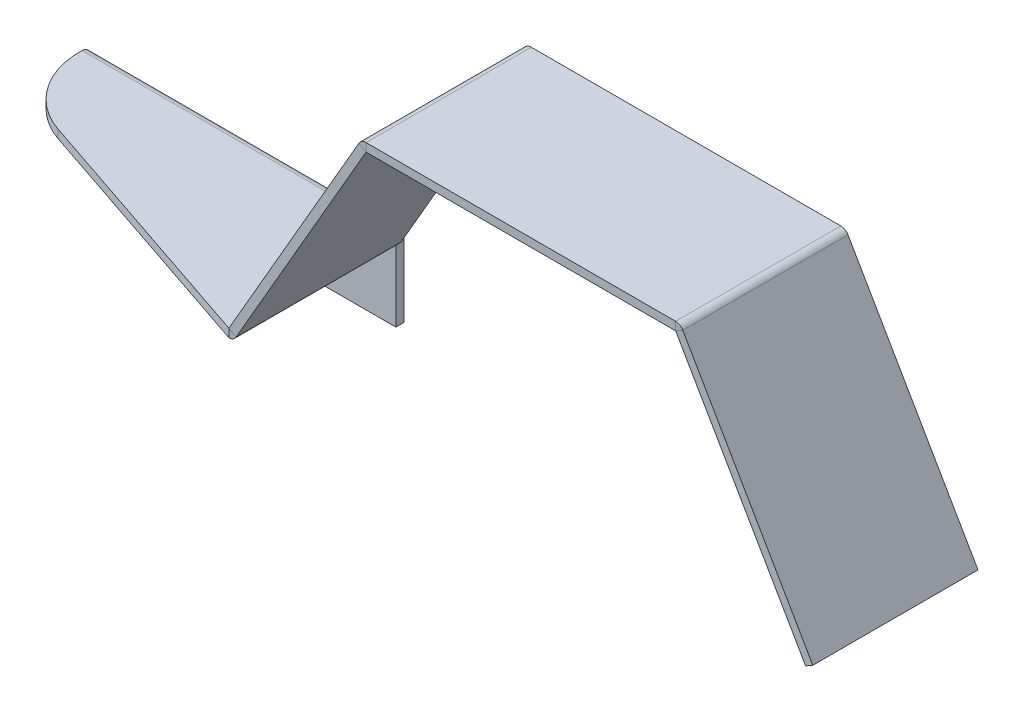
ISO-10303-21;
HEADER;
FILE_DESCRIPTION(('STEP AP214'),'2;1');
FILE_NAME('part.step','',(''),(''),'','','');
FILE_SCHEMA(('AUTOMOTIVE_DESIGN { 1 0 10303 214 1 1 1 1 }'));
ENDSEC;
DATA;
#1=APPLICATION_CONTEXT('core data for automotive mechanical design processes');
#2=APPLICATION_PROTOCOL_DEFINITION('international standard','automotive_design',2000,#1);
#3=PRODUCT_CONTEXT('',#1,'mechanical');
#4=PRODUCT('Part','Part','',(#3));
#5=PRODUCT_RELATED_PRODUCT_CATEGORY('part','',(#4));
#6=PRODUCT_DEFINITION_FORMATION('','',#4);
#7=PRODUCT_DEFINITION_CONTEXT('part definition',#1,'design');
#8=PRODUCT_DEFINITION('design','',#6,#7);
#9=PRODUCT_DEFINITION_SHAPE('','',#8);
#10=(LENGTH_UNIT() NAMED_UNIT(*) SI_UNIT(.MILLI.,.METRE.));
#11=(NAMED_UNIT(*) PLANE_ANGLE_UNIT() SI_UNIT($,.RADIAN.));
#12=(NAMED_UNIT(*) SI_UNIT($,.STERADIAN.) SOLID_ANGLE_UNIT());
#13=UNCERTAINTY_MEASURE_WITH_UNIT(LENGTH_MEASURE(1.E-05),#10,'distance_accuracy_value','');
#14=(GEOMETRIC_REPRESENTATION_CONTEXT(3) GLOBAL_UNCERTAINTY_ASSIGNED_CONTEXT((#13)) GLOBAL_UNIT_ASSIGNED_CONTEXT((#10,
#11,#12)) REPRESENTATION_CONTEXT('',''));
#15=CARTESIAN_POINT('',(0.,0.,0.));
#16=DIRECTION('',(0.,0.,1.));
#17=DIRECTION('',(1.,0.,0.));
#18=AXIS2_PLACEMENT_3D('',#15,#16,#17);
#19=CARTESIAN_POINT('',(50.7385430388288,87.8807344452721,20.2150310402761));
#20=DIRECTION('',(0.,0.,1.));
#21=DIRECTION('',(-0.499999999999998,-0.86602540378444,0.));
#22=AXIS2_PLACEMENT_3D('',#19,#20,#21);
#23=PLANE('',#22);
#24=DIRECTION('',(-0.499999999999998,-0.86602540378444,0.));
#25=VECTOR('',#24,1.);
#26=CARTESIAN_POINT('',(51.6045684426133,87.3807344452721,20.2150310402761));
#27=LINE('',#26,#25);
#28=CARTESIAN_POINT('',(16.6045684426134,26.7589561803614,20.2150310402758));
#29=VERTEX_POINT('',#28);
#30=CARTESIAN_POINT('',(0.866891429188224,-0.499500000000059,20.2150310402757));
#31=VERTEX_POINT('',#30);
#32=EDGE_CURVE('E540',#29,#31,#27,.T.);
#33=ORIENTED_EDGE('',*,*,#32,.F.);
#34=DIRECTION('',(-0.86602540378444,0.499999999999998,0.));
#35=VECTOR('',#34,1.);
#36=CARTESIAN_POINT('',(15.738543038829,27.2589561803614,20.2150310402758));
#37=LINE('',#36,#35);
#38=CARTESIAN_POINT('',(15.738543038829,27.2589561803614,20.2150310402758));
#39=VERTEX_POINT('',#38);
#40=EDGE_CURVE('E533',#29,#39,#37,.T.);
#41=ORIENTED_EDGE('',*,*,#40,.T.);
#42=DIRECTION('',(-0.499999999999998,-0.86602540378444,0.));
#43=VECTOR('',#42,1.);
#44=CARTESIAN_POINT('',(50.7385430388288,87.8807344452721,20.2150310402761));
#45=LINE('',#44,#43);
#46=CARTESIAN_POINT('',(0.000866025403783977,0.00049999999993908,20.2150310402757));
#47=VERTEX_POINT('',#46);
#48=EDGE_CURVE('E61',#39,#47,#45,.T.);
#49=ORIENTED_EDGE('',*,*,#48,.T.);
#50=DIRECTION('',(-0.86602540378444,0.499999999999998,0.));
#51=VECTOR('',#50,1.);
#52=CARTESIAN_POINT('',(0.000866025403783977,0.00049999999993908,20.2150310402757));
#53=LINE('',#52,#51);
#54=EDGE_CURVE('E301',#31,#47,#53,.T.);
#55=ORIENTED_EDGE('',*,*,#54,.F.);
#56=EDGE_LOOP('',(#33,#41,#49,#55));
#57=FACE_BOUND('',#56,.T.);
#58=ADVANCED_FACE('F57',(#57),#23,.T.);
#59=CARTESIAN_POINT('',(-13.3954315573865,-25.202568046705,0.215031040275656));
#60=DIRECTION('',(0.86602540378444,-0.499999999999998,0.));
#61=DIRECTION('',(0.499999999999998,0.86602540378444,0.));
#62=AXIS2_PLACEMENT_3D('',#59,#60,#61);
#63=PLANE('',#62);
#64=DIRECTION('',(0.499999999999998,0.86602540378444,0.));
#65=VECTOR('',#64,1.);
#66=CARTESIAN_POINT('',(0.604568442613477,-0.953856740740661,0.215031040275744));
#67=LINE('',#66,#65);
#68=CARTESIAN_POINT('',(0.866891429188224,-0.499499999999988,0.215031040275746));
#69=VERTEX_POINT('',#68);
#70=CARTESIAN_POINT('',(16.6045684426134,26.7589561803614,0.215031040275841));
#71=VERTEX_POINT('',#70);
#72=EDGE_CURVE('E541',#69,#71,#67,.T.);
#73=ORIENTED_EDGE('',*,*,#72,.T.);
#74=DIRECTION('',(0.,0.,1.));
#75=VECTOR('',#74,1.);
#76=CARTESIAN_POINT('',(16.6045684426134,26.7589561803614,0.215031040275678));
#77=LINE('',#76,#75);
#78=EDGE_CURVE('E66',#71,#29,#77,.T.);
#79=ORIENTED_EDGE('',*,*,#78,.T.);
#80=ORIENTED_EDGE('',*,*,#32,.T.);
#81=DIRECTION('',(0.,0.,1.));
#82=VECTOR('',#81,1.);
#83=CARTESIAN_POINT('',(0.866891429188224,-0.499499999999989,0.215031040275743));
#84=LINE('',#83,#82);
#85=EDGE_CURVE('E304',#69,#31,#84,.T.);
#86=ORIENTED_EDGE('',*,*,#85,.F.);
#87=EDGE_LOOP('',(#73,#79,#80,#86));
#88=FACE_BOUND('',#87,.T.);
#89=ADVANCED_FACE('F618',(#88),#63,.T.);
#90=CARTESIAN_POINT('',(-0.261456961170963,-0.453856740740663,0.215031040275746));
#91=DIRECTION('',(0.,0.,-1.));
#92=DIRECTION('',(-0.86602540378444,0.499999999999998,0.));
#93=AXIS2_PLACEMENT_3D('',#90,#91,#92);
#94=PLANE('',#93);
#95=DIRECTION('',(0.499999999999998,0.86602540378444,0.));
#96=VECTOR('',#95,1.);
#97=CARTESIAN_POINT('',(-0.261456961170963,-0.453856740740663,0.215031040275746));
#98=LINE('',#97,#96);
#99=CARTESIAN_POINT('',(0.00086602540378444,0.00050000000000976,0.215031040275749));
#100=VERTEX_POINT('',#99);
#101=CARTESIAN_POINT('',(15.738543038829,27.2589561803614,0.215031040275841));
#102=VERTEX_POINT('',#101);
#103=EDGE_CURVE('E317',#100,#102,#98,.T.);
#104=ORIENTED_EDGE('',*,*,#103,.T.);
#105=DIRECTION('',(0.86602540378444,-0.499999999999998,0.));
#106=VECTOR('',#105,1.);
#107=CARTESIAN_POINT('',(15.738543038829,27.2589561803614,0.215031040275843));
#108=LINE('',#107,#106);
#109=EDGE_CURVE('E12',#102,#71,#108,.T.);
#110=ORIENTED_EDGE('',*,*,#109,.T.);
#111=ORIENTED_EDGE('',*,*,#72,.F.);
#112=DIRECTION('',(0.86602540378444,-0.499999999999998,0.));
#113=VECTOR('',#112,1.);
#114=CARTESIAN_POINT('',(0.000866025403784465,0.00050000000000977,0.215031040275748));
#115=LINE('',#114,#113);
#116=EDGE_CURVE('E293',#100,#69,#115,.T.);
#117=ORIENTED_EDGE('',*,*,#116,.F.);
#118=EDGE_LOOP('',(#104,#110,#111,#117));
#119=FACE_BOUND('',#118,.T.);
#120=ADVANCED_FACE('F59',(#119),#94,.T.);
#121=CARTESIAN_POINT('',(-28.,-0.99999999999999,0.215031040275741));
#122=DIRECTION('',(0.,-1.,0.));
#123=DIRECTION('',(1.,0.,0.));
#124=AXIS2_PLACEMENT_3D('',#121,#122,#123);
#125=PLANE('',#124);
#126=DIRECTION('',(0.,0.,1.));
#127=VECTOR('',#126,1.);
#128=CARTESIAN_POINT('',(0.,-0.99999999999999,0.215031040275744));
#129=LINE('',#128,#127);
#130=CARTESIAN_POINT('',(0.,-0.99999999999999,0.000999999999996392));
#131=VERTEX_POINT('',#130);
#132=CARTESIAN_POINT('',(0.,-0.99999999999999,0.215031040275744));
#133=VERTEX_POINT('',#132);
#134=EDGE_CURVE('E423',#131,#133,#129,.T.);
#135=ORIENTED_EDGE('',*,*,#134,.T.);
#136=DIRECTION('',(0.,0.,1.));
#137=VECTOR('',#136,1.);
#138=CARTESIAN_POINT('',(0.,-0.99999999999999,0.215031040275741));
#139=LINE('',#138,#137);
#140=CARTESIAN_POINT('',(0.,-1.00000000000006,20.2150310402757));
#141=VERTEX_POINT('',#140);
#142=EDGE_CURVE('E525',#133,#141,#139,.T.);
#143=ORIENTED_EDGE('',*,*,#142,.T.);
#144=DIRECTION('',(-0.947530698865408,0.,-0.319664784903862));
#145=VECTOR('',#144,1.);
#146=CARTESIAN_POINT('',(0.,-1.00000000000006,20.2150310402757));
#147=LINE('',#146,#145);
#148=CARTESIAN_POINT('',(-31.1966478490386,-1.00000000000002,9.69033802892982));
#149=VERTEX_POINT('',#148);
#150=EDGE_CURVE('E518',#141,#149,#147,.T.);
#151=ORIENTED_EDGE('',*,*,#150,.T.);
#152=CARTESIAN_POINT('',(-28.,-0.99999999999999,0.215031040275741));
#153=DIRECTION('',(0.,-1.,0.));
#154=DIRECTION('',(1.,0.,0.));
#155=AXIS2_PLACEMENT_3D('',#152,#153,#154);
#156=CIRCLE('',#155,10.);
#157=CARTESIAN_POINT('',(-37.9977092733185,-0.99999999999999,0.00099999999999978));
#158=VERTEX_POINT('',#157);
#159=EDGE_CURVE('E515',#149,#158,#156,.T.);
#160=ORIENTED_EDGE('',*,*,#159,.T.);
#161=DIRECTION('',(1.,0.,0.));
#162=VECTOR('',#161,1.);
#163=CARTESIAN_POINT('',(-28.,-0.99999999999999,0.000999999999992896));
#164=LINE('',#163,#162);
#165=EDGE_CURVE('E503',#158,#131,#164,.T.);
#166=ORIENTED_EDGE('',*,*,#165,.T.);
#167=EDGE_LOOP('',(#135,#143,#151,#160,#166));
#168=FACE_BOUND('',#167,.T.);
#169=ADVANCED_FACE('F489',(#168),#125,.T.);
#170=CARTESIAN_POINT('',(0.,0.,0.215031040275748));
#171=DIRECTION('',(1.,0.,0.));
#172=DIRECTION('',(0.,0.,1.));
#173=AXIS2_PLACEMENT_3D('',#170,#171,#172);
#174=PLANE('',#173);
#175=ORIENTED_EDGE('',*,*,#134,.F.);
#176=DIRECTION('',(0.,1.,0.));
#177=VECTOR('',#176,1.);
#178=CARTESIAN_POINT('',(0.,0.,0.00100000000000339));
#179=LINE('',#178,#177);
#180=CARTESIAN_POINT('',(0.,0.,0.00100000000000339));
#181=VERTEX_POINT('',#180);
#182=EDGE_CURVE('E512',#131,#181,#179,.T.);
#183=ORIENTED_EDGE('',*,*,#182,.T.);
#184=DIRECTION('',(0.,0.,1.));
#185=VECTOR('',#184,1.);
#186=CARTESIAN_POINT('',(0.,0.,0.215031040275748));
#187=LINE('',#186,#185);
#188=CARTESIAN_POINT('',(0.,0.,0.215031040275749));
#189=VERTEX_POINT('',#188);
#190=EDGE_CURVE('E517',#181,#189,#187,.T.);
#191=ORIENTED_EDGE('',*,*,#190,.T.);
#192=DIRECTION('',(0.,-1.,0.));
#193=VECTOR('',#192,1.);
#194=CARTESIAN_POINT('',(0.,0.,0.215031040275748));
#195=LINE('',#194,#193);
#196=EDGE_CURVE('E528',#189,#133,#195,.T.);
#197=ORIENTED_EDGE('',*,*,#196,.T.);
#198=EDGE_LOOP('',(#175,#183,#191,#197));
#199=FACE_BOUND('',#198,.T.);
#200=ADVANCED_FACE('F486',(#199),#174,.T.);
#201=CARTESIAN_POINT('',(-28.,0.,0.215031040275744));
#202=DIRECTION('',(0.,-1.,0.));
#203=DIRECTION('',(1.,0.,0.));
#204=AXIS2_PLACEMENT_3D('',#201,#202,#203);
#205=CYLINDRICAL_SURFACE('',#204,10.);
#206=CARTESIAN_POINT('',(-28.,0.,0.215031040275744));
#207=DIRECTION('',(0.,-1.,0.));
#208=DIRECTION('',(1.,0.,0.));
#209=AXIS2_PLACEMENT_3D('',#206,#207,#208);
#210=CIRCLE('',#209,10.);
#211=CARTESIAN_POINT('',(-31.1966478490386,0.,9.69033802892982));
#212=VERTEX_POINT('',#211);
#213=CARTESIAN_POINT('',(-37.9977092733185,0.,0.00100000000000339));
#214=VERTEX_POINT('',#213);
#215=EDGE_CURVE('E572',#212,#214,#210,.T.);
#216=ORIENTED_EDGE('',*,*,#215,.T.);
#217=CARTESIAN_POINT('',(-37.9977092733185,-0.99999999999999,0.000999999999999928));
#218=CARTESIAN_POINT('',(-37.9977092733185,0.,0.00100000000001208));
#219=B_SPLINE_CURVE_WITH_KNOTS('',1,(#217,#218),.UNSPECIFIED.,.F.,.F.,(2,2),(0.,1.),.UNSPECIFIED.);
#220=EDGE_CURVE('E511',#214,#158,#219,.F.);
#221=ORIENTED_EDGE('',*,*,#220,.T.);
#222=ORIENTED_EDGE('',*,*,#159,.F.);
#223=DIRECTION('',(0.,-1.,0.));
#224=VECTOR('',#223,1.);
#225=CARTESIAN_POINT('',(-31.1966478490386,0.,9.69033802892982));
#226=LINE('',#225,#224);
#227=EDGE_CURVE('E579',#212,#149,#226,.T.);
#228=ORIENTED_EDGE('',*,*,#227,.F.);
#229=EDGE_LOOP('',(#216,#221,#222,#228));
#230=FACE_BOUND('',#229,.T.);
#231=ADVANCED_FACE('F484',(#230),#205,.T.);
#232=CARTESIAN_POINT('',(0.,0.,20.2150310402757));
#233=DIRECTION('',(-0.319664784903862,0.,0.947530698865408));
#234=DIRECTION('',(-0.947530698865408,0.,-0.319664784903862));
#235=AXIS2_PLACEMENT_3D('',#232,#233,#234);
#236=PLANE('',#235);
#237=ORIENTED_EDGE('',*,*,#150,.F.);
#238=DIRECTION('',(0.,-1.,0.));
#239=VECTOR('',#238,1.);
#240=CARTESIAN_POINT('',(0.,0.,20.2150310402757));
#241=LINE('',#240,#239);
#242=CARTESIAN_POINT('',(0.,0.,20.2150310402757));
#243=VERTEX_POINT('',#242);
#244=EDGE_CURVE('E523',#243,#141,#241,.T.);
#245=ORIENTED_EDGE('',*,*,#244,.F.);
#246=DIRECTION('',(-0.947530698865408,0.,-0.319664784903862));
#247=VECTOR('',#246,1.);
#248=CARTESIAN_POINT('',(0.,0.,20.2150310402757));
#249=LINE('',#248,#247);
#250=EDGE_CURVE('E568',#243,#212,#249,.T.);
#251=ORIENTED_EDGE('',*,*,#250,.T.);
#252=ORIENTED_EDGE('',*,*,#227,.T.);
#253=EDGE_LOOP('',(#237,#245,#251,#252));
#254=FACE_BOUND('',#253,.T.);
#255=ADVANCED_FACE('F480',(#254),#236,.T.);
#256=CARTESIAN_POINT('',(-28.,0.,0.215031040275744));
#257=DIRECTION('',(0.,-1.,0.));
#258=DIRECTION('',(1.,0.,0.));
#259=AXIS2_PLACEMENT_3D('',#256,#257,#258);
#260=PLANE('',#259);
#261=DIRECTION('',(0.,0.,1.));
#262=VECTOR('',#261,1.);
#263=CARTESIAN_POINT('',(0.,0.,0.215031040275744));
#264=LINE('',#263,#262);
#265=EDGE_CURVE('E521',#189,#243,#264,.T.);
#266=ORIENTED_EDGE('',*,*,#265,.F.);
#267=ORIENTED_EDGE('',*,*,#190,.F.);
#268=DIRECTION('',(1.,0.,0.));
#269=VECTOR('',#268,1.);
#270=CARTESIAN_POINT('',(-28.,0.,0.00100000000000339));
#271=LINE('',#270,#269);
#272=EDGE_CURVE('E577',#214,#181,#271,.T.);
#273=ORIENTED_EDGE('',*,*,#272,.F.);
#274=ORIENTED_EDGE('',*,*,#215,.F.);
#275=ORIENTED_EDGE('',*,*,#250,.F.);
#276=EDGE_LOOP('',(#266,#267,#273,#274,#275));
#277=FACE_BOUND('',#276,.T.);
#278=ADVANCED_FACE('F483',(#277),#260,.F.);
#279=CARTESIAN_POINT('',(0.,-10.,-1.));
#280=DIRECTION('',(0.,-1.,0.));
#281=DIRECTION('',(1.,0.,0.));
#282=AXIS2_PLACEMENT_3D('',#279,#280,#281);
#283=PLANE('',#282);
#284=DIRECTION('',(1.,0.,0.));
#285=VECTOR('',#284,1.);
#286=CARTESIAN_POINT('',(0.,-10.,0.));
#287=LINE('',#286,#285);
#288=CARTESIAN_POINT('',(-28.,-10.,0.));
#289=VERTEX_POINT('',#288);
#290=CARTESIAN_POINT('',(0.,-10.,0.));
#291=VERTEX_POINT('',#290);
#292=EDGE_CURVE('E427',#289,#291,#287,.T.);
#293=ORIENTED_EDGE('',*,*,#292,.F.);
#294=DIRECTION('',(0.,0.,1.));
#295=VECTOR('',#294,1.);
#296=CARTESIAN_POINT('',(-28.,-10.,-1.));
#297=LINE('',#296,#295);
#298=CARTESIAN_POINT('',(-28.,-10.,-1.));
#299=VERTEX_POINT('',#298);
#300=EDGE_CURVE('E415',#299,#289,#297,.T.);
#301=ORIENTED_EDGE('',*,*,#300,.F.);
#302=DIRECTION('',(1.,0.,0.));
#303=VECTOR('',#302,1.);
#304=CARTESIAN_POINT('',(0.,-10.,-1.));
#305=LINE('',#304,#303);
#306=CARTESIAN_POINT('',(0.,-10.,-1.));
#307=VERTEX_POINT('',#306);
#308=EDGE_CURVE('E448',#299,#307,#305,.T.);
#309=ORIENTED_EDGE('',*,*,#308,.T.);
#310=DIRECTION('',(0.,0.,1.));
#311=VECTOR('',#310,1.);
#312=CARTESIAN_POINT('',(0.,-10.,-1.));
#313=LINE('',#312,#311);
#314=EDGE_CURVE('E446',#307,#291,#313,.T.);
#315=ORIENTED_EDGE('',*,*,#314,.T.);
#316=EDGE_LOOP('',(#293,#301,#309,#315));
#317=FACE_BOUND('',#316,.T.);
#318=ADVANCED_FACE('F388',(#317),#283,.T.);
#319=CARTESIAN_POINT('',(-28.,-5.,-1.));
#320=DIRECTION('',(0.,0.,1.));
#321=DIRECTION('',(1.,0.,0.));
#322=AXIS2_PLACEMENT_3D('',#319,#320,#321);
#323=CYLINDRICAL_SURFACE('',#322,1.75);
#324=CARTESIAN_POINT('',(-28.,-5.,-1.));
#325=DIRECTION('',(0.,0.,1.));
#326=DIRECTION('',(1.,0.,0.));
#327=AXIS2_PLACEMENT_3D('',#324,#325,#326);
#328=CIRCLE('',#327,1.75);
#329=CARTESIAN_POINT('',(-26.25,-5.,-1.));
#330=VERTEX_POINT('',#329);
#331=EDGE_CURVE('E434',#330,#330,#328,.T.);
#332=ORIENTED_EDGE('',*,*,#331,.F.);
#333=EDGE_LOOP('',(#332));
#334=FACE_BOUND('',#333,.T.);
#335=CARTESIAN_POINT('',(-28.,-5.,0.));
#336=DIRECTION('',(0.,0.,1.));
#337=DIRECTION('',(1.,0.,0.));
#338=AXIS2_PLACEMENT_3D('',#335,#336,#337);
#339=CIRCLE('',#338,1.75);
#340=CARTESIAN_POINT('',(-26.25,-5.,0.));
#341=VERTEX_POINT('',#340);
#342=EDGE_CURVE('E443',#341,#341,#339,.T.);
#343=ORIENTED_EDGE('',*,*,#342,.T.);
#344=EDGE_LOOP('',(#343));
#345=FACE_BOUND('',#344,.T.);
#346=ADVANCED_FACE('F1000',(#334,#345),#323,.F.);
#347=CARTESIAN_POINT('',(-8.,-5.,-1.));
#348=DIRECTION('',(0.,0.,1.));
#349=DIRECTION('',(1.,0.,0.));
#350=AXIS2_PLACEMENT_3D('',#347,#348,#349);
#351=CYLINDRICAL_SURFACE('',#350,1.75);
#352=CARTESIAN_POINT('',(-8.,-5.,-1.));
#353=DIRECTION('',(0.,0.,1.));
#354=DIRECTION('',(1.,0.,0.));
#355=AXIS2_PLACEMENT_3D('',#352,#353,#354);
#356=CIRCLE('',#355,1.75);
#357=CARTESIAN_POINT('',(-6.25,-5.,-1.));
#358=VERTEX_POINT('',#357);
#359=EDGE_CURVE('E437',#358,#358,#356,.T.);
#360=ORIENTED_EDGE('',*,*,#359,.F.);
#361=EDGE_LOOP('',(#360));
#362=FACE_BOUND('',#361,.T.);
#363=CARTESIAN_POINT('',(-8.,-5.,0.));
#364=DIRECTION('',(0.,0.,1.));
#365=DIRECTION('',(1.,0.,0.));
#366=AXIS2_PLACEMENT_3D('',#363,#364,#365);
#367=CIRCLE('',#366,1.75);
#368=CARTESIAN_POINT('',(-6.25,-5.,0.));
#369=VERTEX_POINT('',#368);
#370=EDGE_CURVE('E440',#369,#369,#367,.T.);
#371=ORIENTED_EDGE('',*,*,#370,.T.);
#372=EDGE_LOOP('',(#371));
#373=FACE_BOUND('',#372,.T.);
#374=ADVANCED_FACE('F968',(#362,#373),#351,.F.);
#375=CARTESIAN_POINT('',(-28.,0.,-1.));
#376=DIRECTION('',(0.,0.,1.));
#377=DIRECTION('',(1.,0.,0.));
#378=AXIS2_PLACEMENT_3D('',#375,#376,#377);
#379=PLANE('',#378);
#380=ORIENTED_EDGE('',*,*,#359,.T.);
#381=EDGE_LOOP('',(#380));
#382=FACE_BOUND('',#381,.T.);
#383=ORIENTED_EDGE('',*,*,#331,.T.);
#384=EDGE_LOOP('',(#383));
#385=FACE_BOUND('',#384,.T.);
#386=CARTESIAN_POINT('',(-28.,0.,-1.));
#387=DIRECTION('',(0.,0.,1.));
#388=DIRECTION('',(1.,0.,0.));
#389=AXIS2_PLACEMENT_3D('',#386,#387,#388);
#390=CIRCLE('',#389,10.);
#391=CARTESIAN_POINT('',(-37.9497738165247,-1.00099999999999,-1.));
#392=VERTEX_POINT('',#391);
#393=EDGE_CURVE('E424',#392,#299,#390,.T.);
#394=ORIENTED_EDGE('',*,*,#393,.F.);
#395=DIRECTION('',(1.,0.,0.));
#396=VECTOR('',#395,1.);
#397=CARTESIAN_POINT('',(-28.,-1.00099999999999,-1.));
#398=LINE('',#397,#396);
#399=CARTESIAN_POINT('',(0.,-1.00099999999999,-1.));
#400=VERTEX_POINT('',#399);
#401=EDGE_CURVE('E433',#392,#400,#398,.T.);
#402=ORIENTED_EDGE('',*,*,#401,.T.);
#403=DIRECTION('',(0.,1.,0.));
#404=VECTOR('',#403,1.);
#405=CARTESIAN_POINT('',(0.,0.,-1.));
#406=LINE('',#405,#404);
#407=EDGE_CURVE('E431',#307,#400,#406,.T.);
#408=ORIENTED_EDGE('',*,*,#407,.F.);
#409=ORIENTED_EDGE('',*,*,#308,.F.);
#410=EDGE_LOOP('',(#394,#402,#408,#409));
#411=FACE_BOUND('',#410,.T.);
#412=ADVANCED_FACE('F600',(#382,#385,#411),#379,.F.);
#413=CARTESIAN_POINT('',(0.,0.,-1.));
#414=DIRECTION('',(1.,0.,0.));
#415=DIRECTION('',(0.,1.,0.));
#416=AXIS2_PLACEMENT_3D('',#413,#414,#415);
#417=PLANE('',#416);
#418=DIRECTION('',(0.,0.,-1.));
#419=VECTOR('',#418,1.);
#420=CARTESIAN_POINT('',(0.,-1.00099999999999,-1.00000000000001));
#421=LINE('',#420,#419);
#422=CARTESIAN_POINT('',(0.,-1.001,0.));
#423=VERTEX_POINT('',#422);
#424=EDGE_CURVE('E451',#423,#400,#421,.T.);
#425=ORIENTED_EDGE('',*,*,#424,.F.);
#426=DIRECTION('',(0.,1.,0.));
#427=VECTOR('',#426,1.);
#428=CARTESIAN_POINT('',(0.,0.,0.));
#429=LINE('',#428,#427);
#430=EDGE_CURVE('E425',#291,#423,#429,.T.);
#431=ORIENTED_EDGE('',*,*,#430,.F.);
#432=ORIENTED_EDGE('',*,*,#314,.F.);
#433=ORIENTED_EDGE('',*,*,#407,.T.);
#434=EDGE_LOOP('',(#425,#431,#432,#433));
#435=FACE_BOUND('',#434,.T.);
#436=ADVANCED_FACE('F603',(#435),#417,.T.);
#437=CARTESIAN_POINT('',(-28.,0.,0.));
#438=DIRECTION('',(0.,0.,1.));
#439=DIRECTION('',(1.,0.,0.));
#440=AXIS2_PLACEMENT_3D('',#437,#438,#439);
#441=PLANE('',#440);
#442=DIRECTION('',(1.,0.,0.));
#443=VECTOR('',#442,1.);
#444=CARTESIAN_POINT('',(-28.,-1.001,0.));
#445=LINE('',#444,#443);
#446=CARTESIAN_POINT('',(-37.9497738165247,-1.001,0.));
#447=VERTEX_POINT('',#446);
#448=EDGE_CURVE('E454',#447,#423,#445,.T.);
#449=ORIENTED_EDGE('',*,*,#448,.F.);
#450=CARTESIAN_POINT('',(-28.,0.,0.));
#451=DIRECTION('',(0.,0.,1.));
#452=DIRECTION('',(1.,0.,0.));
#453=AXIS2_PLACEMENT_3D('',#450,#451,#452);
#454=CIRCLE('',#453,10.);
#455=EDGE_CURVE('E430',#447,#289,#454,.T.);
#456=ORIENTED_EDGE('',*,*,#455,.T.);
#457=ORIENTED_EDGE('',*,*,#292,.T.);
#458=ORIENTED_EDGE('',*,*,#430,.T.);
#459=EDGE_LOOP('',(#449,#456,#457,#458));
#460=FACE_BOUND('',#459,.T.);
#461=ORIENTED_EDGE('',*,*,#342,.F.);
#462=EDGE_LOOP('',(#461));
#463=FACE_BOUND('',#462,.T.);
#464=ORIENTED_EDGE('',*,*,#370,.F.);
#465=EDGE_LOOP('',(#464));
#466=FACE_BOUND('',#465,.T.);
#467=ADVANCED_FACE('F478',(#460,#463,#466),#441,.T.);
#468=CARTESIAN_POINT('',(-28.,0.,-1.));
#469=DIRECTION('',(0.,0.,1.));
#470=DIRECTION('',(1.,0.,0.));
#471=AXIS2_PLACEMENT_3D('',#468,#469,#470);
#472=CYLINDRICAL_SURFACE('',#471,10.);
#473=CARTESIAN_POINT('',(-37.9497738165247,-1.00099999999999,-1.));
#474=CARTESIAN_POINT('',(-37.9497738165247,-1.00099999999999,0.));
#475=B_SPLINE_CURVE_WITH_KNOTS('',1,(#473,#474),.UNSPECIFIED.,.F.,.F.,(2,2),(0.,1.),.UNSPECIFIED.);
#476=EDGE_CURVE('E323',#392,#447,#475,.T.);
#477=ORIENTED_EDGE('',*,*,#476,.F.);
#478=ORIENTED_EDGE('',*,*,#393,.T.);
#479=ORIENTED_EDGE('',*,*,#300,.T.);
#480=ORIENTED_EDGE('',*,*,#455,.F.);
#481=EDGE_LOOP('',(#477,#478,#479,#480));
#482=FACE_BOUND('',#481,.T.);
#483=ADVANCED_FACE('F387',(#482),#472,.T.);
#484=CARTESIAN_POINT('',(-37.9497738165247,-1.00099999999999,-1.));
#485=CARTESIAN_POINT('',(-37.9537691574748,-0.869945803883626,-1.));
#486=CARTESIAN_POINT('',(-37.9577630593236,-0.738990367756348,-0.973946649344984));
#487=CARTESIAN_POINT('',(-37.9657523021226,-0.496877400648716,-0.87366017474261));
#488=CARTESIAN_POINT('',(-37.9697469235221,-0.385838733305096,-0.799466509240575));
#489=CARTESIAN_POINT('',(-37.9777361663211,-0.200533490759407,-0.614161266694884));
#490=CARTESIAN_POINT('',(-37.9817307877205,-0.126339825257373,-0.503122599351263));
#491=CARTESIAN_POINT('',(-37.9897200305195,-0.026053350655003,-0.26100963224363));
#492=CARTESIAN_POINT('',(-37.9937139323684,0.,-0.130054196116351));
#493=CARTESIAN_POINT('',(-37.9977092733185,0.,0.00100000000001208));
#494=CARTESIAN_POINT('',(-37.9497738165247,-1.00099999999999,0.));
#495=CARTESIAN_POINT('',(-37.9537684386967,-1.00086910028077,0.));
#496=CARTESIAN_POINT('',(-37.9577630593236,-1.00073825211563,2.60273233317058E-05));
#497=CARTESIAN_POINT('',(-37.9657523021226,-1.00049638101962,0.000126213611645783));
#498=CARTESIAN_POINT('',(-37.9697469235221,-1.00038545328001,0.000200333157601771));
#499=CARTESIAN_POINT('',(-37.9777361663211,-1.00020033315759,0.00038545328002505));
#500=CARTESIAN_POINT('',(-37.9817307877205,-1.00012621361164,0.000496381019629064));
#501=CARTESIAN_POINT('',(-37.9897200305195,-1.00002602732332,0.000738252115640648));
#502=CARTESIAN_POINT('',(-37.9937146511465,-0.99999999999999,0.000869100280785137));
#503=CARTESIAN_POINT('',(-37.9977092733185,-0.99999999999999,0.000999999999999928));
#504=B_SPLINE_SURFACE_WITH_KNOTS('',1,3,((#484,#485,#486,#487,#488,#489,#490,#491,#492,#493),
(#494,#495,#496,#497,#498,#499,#500,#501,#502,#503)),.UNSPECIFIED.,.F.,.F.,.F.,(2,2),(4,2,2,2,
4),(0.,1.),(0.,0.25,0.5,0.75,1.),.UNSPECIFIED.);
#505=CARTESIAN_POINT('',(-37.9497738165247,-1.00099999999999,0.));
#506=CARTESIAN_POINT('',(-37.9537684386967,-1.00086910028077,0.));
#507=CARTESIAN_POINT('',(-37.9577630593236,-1.00073825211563,2.60273233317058E-05));
#508=CARTESIAN_POINT('',(-37.9657523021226,-1.00049638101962,0.000126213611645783));
#509=CARTESIAN_POINT('',(-37.9697469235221,-1.00038545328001,0.000200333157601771));
#510=CARTESIAN_POINT('',(-37.9777361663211,-1.00020033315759,0.00038545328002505));
#511=CARTESIAN_POINT('',(-37.9817307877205,-1.00012621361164,0.000496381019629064));
#512=CARTESIAN_POINT('',(-37.9897200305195,-1.00002602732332,0.000738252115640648));
#513=CARTESIAN_POINT('',(-37.9937146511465,-0.99999999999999,0.000869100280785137));
#514=CARTESIAN_POINT('',(-37.9977092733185,-0.99999999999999,0.000999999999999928));
#515=B_SPLINE_CURVE_WITH_KNOTS('',3,(#505,#506,#507,#508,#509,#510,#511,#512,#513,#514),
.UNSPECIFIED.,.F.,.F.,(4,2,2,2,4),(0.,0.25,0.5,0.75,1.),.UNSPECIFIED.);
#516=EDGE_CURVE('E315',#447,#158,#515,.T.);
#517=CARTESIAN_POINT('',(-37.9977092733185,0.,0.00100000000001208));
#518=CARTESIAN_POINT('',(-37.9937139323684,0.,-0.130054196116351));
#519=CARTESIAN_POINT('',(-37.9897200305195,-0.026053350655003,-0.26100963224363));
#520=CARTESIAN_POINT('',(-37.9817307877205,-0.126339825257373,-0.503122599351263));
#521=CARTESIAN_POINT('',(-37.9777361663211,-0.200533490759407,-0.614161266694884));
#522=CARTESIAN_POINT('',(-37.9697469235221,-0.385838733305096,-0.799466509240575));
#523=CARTESIAN_POINT('',(-37.9657523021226,-0.496877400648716,-0.87366017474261));
#524=CARTESIAN_POINT('',(-37.9577630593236,-0.738990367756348,-0.973946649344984));
#525=CARTESIAN_POINT('',(-37.9537691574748,-0.869945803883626,-1.));
#526=CARTESIAN_POINT('',(-37.9497738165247,-1.00099999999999,-1.));
#527=B_SPLINE_CURVE_WITH_KNOTS('',3,(#517,#518,#519,#520,#521,#522,#523,#524,#525,#526),
.UNSPECIFIED.,.F.,.F.,(4,2,2,2,4),(0.,0.25,0.5,0.75,1.),.UNSPECIFIED.);
#528=EDGE_CURVE('E324',#392,#214,#527,.F.);
#529=ORIENTED_EDGE('',*,*,#476,.T.);
#530=ORIENTED_EDGE('',*,*,#516,.T.);
#531=ORIENTED_EDGE('',*,*,#220,.F.);
#532=ORIENTED_EDGE('',*,*,#528,.F.);
#533=EDGE_LOOP('',(#529,#530,#531,#532));
#534=FACE_BOUND('',#533,.T.);
#535=ADVANCED_FACE('F376',(#534),#504,.T.);
#536=CARTESIAN_POINT('',(0.,-1.00099999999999,0.000999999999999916));
#537=DIRECTION('',(1.,0.,0.));
#538=DIRECTION('',(0.,0.,-1.));
#539=AXIS2_PLACEMENT_3D('',#536,#537,#538);
#540=PLANE('',#539);
#541=ORIENTED_EDGE('',*,*,#182,.F.);
#542=CARTESIAN_POINT('',(0.,-1.00099999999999,0.000999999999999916));
#543=DIRECTION('',(1.,0.,0.));
#544=DIRECTION('',(0.,0.,-1.));
#545=AXIS2_PLACEMENT_3D('',#542,#543,#544);
#546=CIRCLE('',#545,0.000999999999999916);
#547=EDGE_CURVE('E325',#131,#423,#546,.F.);
#548=ORIENTED_EDGE('',*,*,#547,.T.);
#549=ORIENTED_EDGE('',*,*,#424,.T.);
#550=CARTESIAN_POINT('',(0.,-1.00099999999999,0.000999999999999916));
#551=DIRECTION('',(-1.,0.,0.));
#552=DIRECTION('',(0.,0.,-1.));
#553=AXIS2_PLACEMENT_3D('',#550,#551,#552);
#554=CIRCLE('',#553,1.001);
#555=EDGE_CURVE('E320',#181,#400,#554,.T.);
#556=ORIENTED_EDGE('',*,*,#555,.F.);
#557=EDGE_LOOP('',(#541,#548,#549,#556));
#558=FACE_BOUND('',#557,.T.);
#559=ADVANCED_FACE('F345',(#558),#540,.T.);
#560=CARTESIAN_POINT('',(-56.9938983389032,-1.00099999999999,0.000999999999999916));
#561=DIRECTION('',(1.,0.,0.));
#562=DIRECTION('',(0.,0.,-1.));
#563=AXIS2_PLACEMENT_3D('',#560,#561,#562);
#564=CYLINDRICAL_SURFACE('',#563,1.001);
#565=ORIENTED_EDGE('',*,*,#555,.T.);
#566=ORIENTED_EDGE('',*,*,#401,.F.);
#567=ORIENTED_EDGE('',*,*,#528,.T.);
#568=ORIENTED_EDGE('',*,*,#272,.T.);
#569=EDGE_LOOP('',(#565,#566,#567,#568));
#570=FACE_BOUND('',#569,.T.);
#571=ADVANCED_FACE('F334',(#570),#564,.T.);
#572=CARTESIAN_POINT('',(-56.9938983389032,-1.00099999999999,0.000999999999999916));
#573=DIRECTION('',(1.,0.,0.));
#574=DIRECTION('',(0.,0.,-1.));
#575=AXIS2_PLACEMENT_3D('',#572,#573,#574);
#576=CYLINDRICAL_SURFACE('',#575,0.000999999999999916);
#577=ORIENTED_EDGE('',*,*,#547,.F.);
#578=ORIENTED_EDGE('',*,*,#165,.F.);
#579=ORIENTED_EDGE('',*,*,#516,.F.);
#580=ORIENTED_EDGE('',*,*,#448,.T.);
#581=EDGE_LOOP('',(#577,#578,#579,#580));
#582=FACE_BOUND('',#581,.T.);
#583=ADVANCED_FACE('F344',(#582),#576,.F.);
#584=CARTESIAN_POINT('',(0.,0.00100000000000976,0.215031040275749));
#585=DIRECTION('',(0.,0.,1.));
#586=DIRECTION('',(1.,0.,0.));
#587=AXIS2_PLACEMENT_3D('',#584,#585,#586);
#588=PLANE('',#587);
#589=ORIENTED_EDGE('',*,*,#116,.T.);
#590=CARTESIAN_POINT('',(0.,0.00100000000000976,0.215031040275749));
#591=DIRECTION('',(0.,0.,-1.));
#592=DIRECTION('',(0.,1.,0.));
#593=AXIS2_PLACEMENT_3D('',#590,#591,#592);
#594=CIRCLE('',#593,1.001);
#595=EDGE_CURVE('E82',#69,#133,#594,.T.);
#596=ORIENTED_EDGE('',*,*,#595,.T.);
#597=ORIENTED_EDGE('',*,*,#196,.F.);
#598=CARTESIAN_POINT('',(0.,0.00100000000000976,0.215031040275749));
#599=DIRECTION('',(0.,0.,-1.));
#600=DIRECTION('',(1.,0.,0.));
#601=AXIS2_PLACEMENT_3D('',#598,#599,#600);
#602=CIRCLE('',#601,0.001);
#603=EDGE_CURVE('E308',#100,#189,#602,.T.);
#604=ORIENTED_EDGE('',*,*,#603,.F.);
#605=EDGE_LOOP('',(#589,#596,#597,#604));
#606=FACE_BOUND('',#605,.T.);
#607=ADVANCED_FACE('F352',(#606),#588,.F.);
#608=CARTESIAN_POINT('',(0.,0.000999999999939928,20.2150310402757));
#609=DIRECTION('',(0.,0.,-1.));
#610=DIRECTION('',(-1.,0.,0.));
#611=AXIS2_PLACEMENT_3D('',#608,#609,#610);
#612=PLANE('',#611);
#613=CARTESIAN_POINT('',(0.,0.000999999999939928,20.2150310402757));
#614=DIRECTION('',(0.,0.,-1.));
#615=DIRECTION('',(0.,1.,0.));
#616=AXIS2_PLACEMENT_3D('',#613,#614,#615);
#617=CIRCLE('',#616,1.001);
#618=EDGE_CURVE('E312',#141,#31,#617,.F.);
#619=ORIENTED_EDGE('',*,*,#618,.T.);
#620=ORIENTED_EDGE('',*,*,#54,.T.);
#621=CARTESIAN_POINT('',(0.,0.000999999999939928,20.2150310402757));
#622=DIRECTION('',(0.,0.,1.));
#623=DIRECTION('',(-1.,0.,0.));
#624=AXIS2_PLACEMENT_3D('',#621,#622,#623);
#625=CIRCLE('',#624,0.001);
#626=EDGE_CURVE('E311',#243,#47,#625,.T.);
#627=ORIENTED_EDGE('',*,*,#626,.F.);
#628=ORIENTED_EDGE('',*,*,#244,.T.);
#629=EDGE_LOOP('',(#619,#620,#627,#628));
#630=FACE_BOUND('',#629,.T.);
#631=ADVANCED_FACE('F347',(#630),#612,.F.);
#632=CARTESIAN_POINT('',(0.,0.000999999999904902,30.2468870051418));
#633=DIRECTION('',(0.,0.,-1.));
#634=DIRECTION('',(0.,1.,0.));
#635=AXIS2_PLACEMENT_3D('',#632,#633,#634);
#636=CYLINDRICAL_SURFACE('',#635,0.001);
#637=ORIENTED_EDGE('',*,*,#265,.T.);
#638=ORIENTED_EDGE('',*,*,#626,.T.);
#639=DIRECTION('',(0.,0.,1.));
#640=VECTOR('',#639,1.);
#641=CARTESIAN_POINT('',(0.000866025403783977,0.000500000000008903,0.215031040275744));
#642=LINE('',#641,#640);
#643=EDGE_CURVE('E298',#100,#47,#642,.T.);
#644=ORIENTED_EDGE('',*,*,#643,.F.);
#645=ORIENTED_EDGE('',*,*,#603,.T.);
#646=EDGE_LOOP('',(#637,#638,#644,#645));
#647=FACE_BOUND('',#646,.T.);
#648=ADVANCED_FACE('F560',(#647),#636,.F.);
#649=CARTESIAN_POINT('',(0.,0.000999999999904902,30.2468870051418));
#650=DIRECTION('',(0.,0.,-1.));
#651=DIRECTION('',(0.,1.,0.));
#652=AXIS2_PLACEMENT_3D('',#649,#650,#651);
#653=CYLINDRICAL_SURFACE('',#652,1.001);
#654=ORIENTED_EDGE('',*,*,#142,.F.);
#655=ORIENTED_EDGE('',*,*,#595,.F.);
#656=ORIENTED_EDGE('',*,*,#85,.T.);
#657=ORIENTED_EDGE('',*,*,#618,.F.);
#658=EDGE_LOOP('',(#654,#655,#656,#657));
#659=FACE_BOUND('',#658,.T.);
#660=ADVANCED_FACE('F626',(#659),#653,.T.);
#661=CARTESIAN_POINT('',(-14.2614569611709,-24.702568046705,0.215031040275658));
#662=DIRECTION('',(0.86602540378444,-0.499999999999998,0.));
#663=DIRECTION('',(0.499999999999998,0.86602540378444,0.));
#664=AXIS2_PLACEMENT_3D('',#661,#662,#663);
#665=PLANE('',#664);
#666=DIRECTION('',(0.,0.,1.));
#667=VECTOR('',#666,1.);
#668=CARTESIAN_POINT('',(15.738543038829,27.2589561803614,0.21503104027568));
#669=LINE('',#668,#667);
#670=EDGE_CURVE('E531',#102,#39,#669,.T.);
#671=ORIENTED_EDGE('',*,*,#670,.F.);
#672=ORIENTED_EDGE('',*,*,#103,.F.);
#673=ORIENTED_EDGE('',*,*,#643,.T.);
#674=ORIENTED_EDGE('',*,*,#48,.F.);
#675=EDGE_LOOP('',(#671,#672,#673,#674));
#676=FACE_BOUND('',#675,.T.);
#677=ADVANCED_FACE('F553',(#676),#665,.F.);
#678=CARTESIAN_POINT('',(16.6054344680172,26.7584561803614,0.215031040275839));
#679=DIRECTION('',(0.,0.,-1.));
#680=DIRECTION('',(-1.,0.,0.));
#681=AXIS2_PLACEMENT_3D('',#678,#679,#680);
#682=PLANE('',#681);
#683=DIRECTION('',(0.,-1.,0.));
#684=VECTOR('',#683,1.);
#685=CARTESIAN_POINT('',(16.6054344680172,27.7594561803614,0.215031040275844));
#686=LINE('',#685,#684);
#687=CARTESIAN_POINT('',(16.6054344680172,27.7594561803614,0.215031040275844));
#688=VERTEX_POINT('',#687);
#689=CARTESIAN_POINT('',(16.6054344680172,26.7594561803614,0.215031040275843));
#690=VERTEX_POINT('',#689);
#691=EDGE_CURVE('E284',#688,#690,#686,.T.);
#692=ORIENTED_EDGE('',*,*,#691,.T.);
#693=CARTESIAN_POINT('',(16.6054344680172,26.7584561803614,0.215031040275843));
#694=DIRECTION('',(0.,0.,-1.));
#695=DIRECTION('',(-1.,0.,0.));
#696=AXIS2_PLACEMENT_3D('',#693,#694,#695);
#697=CIRCLE('',#696,0.000999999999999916);
#698=EDGE_CURVE('E74',#690,#71,#697,.F.);
#699=ORIENTED_EDGE('',*,*,#698,.T.);
#700=ORIENTED_EDGE('',*,*,#109,.F.);
#701=CARTESIAN_POINT('',(16.6054344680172,26.7584561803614,0.215031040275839));
#702=DIRECTION('',(0.,0.,1.));
#703=DIRECTION('',(-1.,0.,0.));
#704=AXIS2_PLACEMENT_3D('',#701,#702,#703);
#705=CIRCLE('',#704,1.001);
#706=EDGE_CURVE('E286',#688,#102,#705,.T.);
#707=ORIENTED_EDGE('',*,*,#706,.F.);
#708=EDGE_LOOP('',(#692,#699,#700,#707));
#709=FACE_BOUND('',#708,.T.);
#710=ADVANCED_FACE('F625',(#709),#682,.T.);
#711=CARTESIAN_POINT('',(16.6054344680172,26.7584561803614,20.2150310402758));
#712=DIRECTION('',(0.,0.,1.));
#713=DIRECTION('',(0.,-1.,0.));
#714=AXIS2_PLACEMENT_3D('',#711,#712,#713);
#715=PLANE('',#714);
#716=CARTESIAN_POINT('',(16.6054344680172,26.7584561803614,20.2150310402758));
#717=DIRECTION('',(0.,0.,-1.));
#718=DIRECTION('',(-1.,0.,0.));
#719=AXIS2_PLACEMENT_3D('',#716,#717,#718);
#720=CIRCLE('',#719,0.000999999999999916);
#721=CARTESIAN_POINT('',(16.6054344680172,26.7594561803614,20.2150310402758));
#722=VERTEX_POINT('',#721);
#723=EDGE_CURVE('E290',#29,#722,#720,.T.);
#724=ORIENTED_EDGE('',*,*,#723,.T.);
#725=DIRECTION('',(0.,1.,0.));
#726=VECTOR('',#725,1.);
#727=CARTESIAN_POINT('',(16.6054344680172,27.7594561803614,20.2150310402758));
#728=LINE('',#727,#726);
#729=CARTESIAN_POINT('',(16.6054344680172,27.7594561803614,20.2150310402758));
#730=VERTEX_POINT('',#729);
#731=EDGE_CURVE('E279',#722,#730,#728,.T.);
#732=ORIENTED_EDGE('',*,*,#731,.T.);
#733=CARTESIAN_POINT('',(16.6054344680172,26.7584561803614,20.2150310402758));
#734=DIRECTION('',(0.,0.,-1.));
#735=DIRECTION('',(0.,-1.,0.));
#736=AXIS2_PLACEMENT_3D('',#733,#734,#735);
#737=CIRCLE('',#736,1.001);
#738=EDGE_CURVE('E289',#39,#730,#737,.T.);
#739=ORIENTED_EDGE('',*,*,#738,.F.);
#740=ORIENTED_EDGE('',*,*,#40,.F.);
#741=EDGE_LOOP('',(#724,#732,#739,#740));
#742=FACE_BOUND('',#741,.T.);
#743=ADVANCED_FACE('F640',(#742),#715,.T.);
#744=CARTESIAN_POINT('',(16.6054344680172,26.7584561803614,30.2695558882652));
#745=DIRECTION('',(0.,0.,-1.));
#746=DIRECTION('',(-1.,0.,0.));
#747=AXIS2_PLACEMENT_3D('',#744,#745,#746);
#748=CYLINDRICAL_SURFACE('',#747,1.001);
#749=ORIENTED_EDGE('',*,*,#670,.T.);
#750=ORIENTED_EDGE('',*,*,#738,.T.);
#751=DIRECTION('',(0.,0.,1.));
#752=VECTOR('',#751,1.);
#753=CARTESIAN_POINT('',(16.6054344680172,27.7594561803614,0.215031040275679));
#754=LINE('',#753,#752);
#755=EDGE_CURVE('E231',#688,#730,#754,.T.);
#756=ORIENTED_EDGE('',*,*,#755,.F.);
#757=ORIENTED_EDGE('',*,*,#706,.T.);
#758=EDGE_LOOP('',(#749,#750,#756,#757));
#759=FACE_BOUND('',#758,.T.);
#760=ADVANCED_FACE('F637',(#759),#748,.T.);
#761=CARTESIAN_POINT('',(16.6054344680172,26.7584561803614,30.2695558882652));
#762=DIRECTION('',(0.,0.,-1.));
#763=DIRECTION('',(-1.,0.,0.));
#764=AXIS2_PLACEMENT_3D('',#761,#762,#763);
#765=CYLINDRICAL_SURFACE('',#764,0.000999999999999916);
#766=ORIENTED_EDGE('',*,*,#78,.F.);
#767=ORIENTED_EDGE('',*,*,#698,.F.);
#768=DIRECTION('',(0.,0.,1.));
#769=VECTOR('',#768,1.);
#770=CARTESIAN_POINT('',(16.6054344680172,26.7594561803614,0.215031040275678));
#771=LINE('',#770,#769);
#772=EDGE_CURVE('E281',#690,#722,#771,.T.);
#773=ORIENTED_EDGE('',*,*,#772,.T.);
#774=ORIENTED_EDGE('',*,*,#723,.F.);
#775=EDGE_LOOP('',(#766,#767,#773,#774));
#776=FACE_BOUND('',#775,.T.);
#777=ADVANCED_FACE('F644',(#776),#765,.F.);
#778=CARTESIAN_POINT('',(70.6853569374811,0.000500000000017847,0.215031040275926));
#779=DIRECTION('',(0.499999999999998,-0.86602540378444,0.));
#780=DIRECTION('',(0.86602540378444,0.499999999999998,0.));
#781=AXIS2_PLACEMENT_3D('',#778,#779,#780);
#782=PLANE('',#781);
#783=DIRECTION('',(0.,0.,1.));
#784=VECTOR('',#783,1.);
#785=CARTESIAN_POINT('',(69.8193315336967,-0.499499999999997,0.215031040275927));
#786=LINE('',#785,#784);
#787=CARTESIAN_POINT('',(69.8193315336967,-0.499499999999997,0.215031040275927));
#788=VERTEX_POINT('',#787);
#789=CARTESIAN_POINT('',(69.8193315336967,-0.499499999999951,20.2150310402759));
#790=VERTEX_POINT('',#789);
#791=EDGE_CURVE('E264',#788,#790,#786,.T.);
#792=ORIENTED_EDGE('',*,*,#791,.F.);
#793=DIRECTION('',(-0.86602540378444,-0.499999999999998,0.));
#794=VECTOR('',#793,1.);
#795=CARTESIAN_POINT('',(70.6853569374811,0.000500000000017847,0.215031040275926));
#796=LINE('',#795,#794);
#797=CARTESIAN_POINT('',(70.6853569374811,0.000500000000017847,0.215031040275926));
#798=VERTEX_POINT('',#797);
#799=EDGE_CURVE('E269',#798,#788,#796,.T.);
#800=ORIENTED_EDGE('',*,*,#799,.F.);
#801=DIRECTION('',(0.,0.,1.));
#802=VECTOR('',#801,1.);
#803=CARTESIAN_POINT('',(70.6853569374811,0.000500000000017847,0.215031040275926));
#804=LINE('',#803,#802);
#805=CARTESIAN_POINT('',(70.6853569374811,0.000500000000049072,20.2150310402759));
#806=VERTEX_POINT('',#805);
#807=EDGE_CURVE('E276',#798,#806,#804,.T.);
#808=ORIENTED_EDGE('',*,*,#807,.T.);
#809=DIRECTION('',(-0.86602540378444,-0.499999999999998,0.));
#810=VECTOR('',#809,1.);
#811=CARTESIAN_POINT('',(70.6853569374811,0.000500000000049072,20.2150310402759));
#812=LINE('',#811,#810);
#813=EDGE_CURVE('E274',#806,#790,#812,.T.);
#814=ORIENTED_EDGE('',*,*,#813,.T.);
#815=EDGE_LOOP('',(#792,#800,#808,#814));
#816=FACE_BOUND('',#815,.T.);
#817=ADVANCED_FACE('F677',(#816),#782,.T.);
#818=CARTESIAN_POINT('',(19.6853569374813,88.3350911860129,0.215031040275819));
#819=DIRECTION('',(0.,0.,-1.));
#820=DIRECTION('',(0.86602540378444,0.499999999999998,0.));
#821=AXIS2_PLACEMENT_3D('',#818,#819,#820);
#822=PLANE('',#821);
#823=DIRECTION('',(-0.86602540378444,-0.499999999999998,0.));
#824=VECTOR('',#823,1.);
#825=CARTESIAN_POINT('',(54.9476799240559,27.2589561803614,0.215031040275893));
#826=LINE('',#825,#824);
#827=CARTESIAN_POINT('',(54.9476799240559,27.2589561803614,0.215031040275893));
#828=VERTEX_POINT('',#827);
#829=CARTESIAN_POINT('',(54.0816545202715,26.7589561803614,0.215031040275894));
#830=VERTEX_POINT('',#829);
#831=EDGE_CURVE('E254',#828,#830,#826,.T.);
#832=ORIENTED_EDGE('',*,*,#831,.F.);
#833=DIRECTION('',(0.499999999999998,-0.86602540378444,0.));
#834=VECTOR('',#833,1.);
#835=CARTESIAN_POINT('',(19.6853569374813,88.3350911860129,0.215031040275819));
#836=LINE('',#835,#834);
#837=EDGE_CURVE('E272',#828,#798,#836,.T.);
#838=ORIENTED_EDGE('',*,*,#837,.T.);
#839=ORIENTED_EDGE('',*,*,#799,.T.);
#840=DIRECTION('',(0.499999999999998,-0.86602540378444,0.));
#841=VECTOR('',#840,1.);
#842=CARTESIAN_POINT('',(18.8193315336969,87.8350911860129,0.21503104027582));
#843=LINE('',#842,#841);
#844=EDGE_CURVE('E267',#830,#788,#843,.T.);
#845=ORIENTED_EDGE('',*,*,#844,.F.);
#846=EDGE_LOOP('',(#832,#838,#839,#845));
#847=FACE_BOUND('',#846,.T.);
#848=ADVANCED_FACE('F669',(#847),#822,.T.);
#849=CARTESIAN_POINT('',(4.81933153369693,112.083802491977,0.215031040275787));
#850=DIRECTION('',(-0.86602540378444,-0.499999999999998,0.));
#851=DIRECTION('',(0.499999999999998,-0.86602540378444,0.));
#852=AXIS2_PLACEMENT_3D('',#849,#850,#851);
#853=PLANE('',#852);
#854=DIRECTION('',(0.,0.,1.));
#855=VECTOR('',#854,1.);
#856=CARTESIAN_POINT('',(54.0816545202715,26.7589561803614,0.215031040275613));
#857=LINE('',#856,#855);
#858=CARTESIAN_POINT('',(54.0816545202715,26.7589561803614,20.2150310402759));
#859=VERTEX_POINT('',#858);
#860=EDGE_CURVE('E249',#830,#859,#857,.T.);
#861=ORIENTED_EDGE('',*,*,#860,.F.);
#862=ORIENTED_EDGE('',*,*,#844,.T.);
#863=ORIENTED_EDGE('',*,*,#791,.T.);
#864=DIRECTION('',(-0.499999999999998,0.86602540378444,0.));
#865=VECTOR('',#864,1.);
#866=CARTESIAN_POINT('',(69.8193315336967,-0.499499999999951,20.2150310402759));
#867=LINE('',#866,#865);
#868=EDGE_CURVE('E262',#790,#859,#867,.T.);
#869=ORIENTED_EDGE('',*,*,#868,.T.);
#870=EDGE_LOOP('',(#861,#862,#863,#869));
#871=FACE_BOUND('',#870,.T.);
#872=ADVANCED_FACE('F663',(#871),#853,.T.);
#873=CARTESIAN_POINT('',(70.6853569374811,0.000500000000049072,20.2150310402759));
#874=DIRECTION('',(0.,0.,1.));
#875=DIRECTION('',(-0.499999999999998,0.86602540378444,0.));
#876=AXIS2_PLACEMENT_3D('',#873,#874,#875);
#877=PLANE('',#876);
#878=DIRECTION('',(0.86602540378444,0.499999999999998,0.));
#879=VECTOR('',#878,1.);
#880=CARTESIAN_POINT('',(54.9476799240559,27.2589561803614,20.2150310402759));
#881=LINE('',#880,#879);
#882=CARTESIAN_POINT('',(54.9476799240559,27.2589561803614,20.2150310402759));
#883=VERTEX_POINT('',#882);
#884=EDGE_CURVE('E216',#859,#883,#881,.T.);
#885=ORIENTED_EDGE('',*,*,#884,.F.);
#886=ORIENTED_EDGE('',*,*,#868,.F.);
#887=ORIENTED_EDGE('',*,*,#813,.F.);
#888=DIRECTION('',(-0.499999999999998,0.86602540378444,0.));
#889=VECTOR('',#888,1.);
#890=CARTESIAN_POINT('',(70.6853569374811,0.000500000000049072,20.2150310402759));
#891=LINE('',#890,#889);
#892=EDGE_CURVE('E259',#806,#883,#891,.T.);
#893=ORIENTED_EDGE('',*,*,#892,.T.);
#894=EDGE_LOOP('',(#885,#886,#887,#893));
#895=FACE_BOUND('',#894,.T.);
#896=ADVANCED_FACE('F679',(#895),#877,.T.);
#897=CARTESIAN_POINT('',(5.68535693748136,112.583802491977,0.215031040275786));
#898=DIRECTION('',(-0.86602540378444,-0.499999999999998,0.));
#899=DIRECTION('',(0.499999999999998,-0.86602540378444,0.));
#900=AXIS2_PLACEMENT_3D('',#897,#898,#899);
#901=PLANE('',#900);
#902=ORIENTED_EDGE('',*,*,#837,.F.);
#903=DIRECTION('',(0.,0.,1.));
#904=VECTOR('',#903,1.);
#905=CARTESIAN_POINT('',(54.9476799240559,27.2589561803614,0.215031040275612));
#906=LINE('',#905,#904);
#907=EDGE_CURVE('E257',#828,#883,#906,.T.);
#908=ORIENTED_EDGE('',*,*,#907,.T.);
#909=ORIENTED_EDGE('',*,*,#892,.F.);
#910=ORIENTED_EDGE('',*,*,#807,.F.);
#911=EDGE_LOOP('',(#902,#908,#909,#910));
#912=FACE_BOUND('',#911,.T.);
#913=ADVANCED_FACE('F673',(#912),#901,.F.);
#914=CARTESIAN_POINT('',(54.0807884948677,26.7584561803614,0.21503104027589));
#915=DIRECTION('',(0.,0.,-1.));
#916=DIRECTION('',(-0.499999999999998,0.86602540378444,0.));
#917=AXIS2_PLACEMENT_3D('',#914,#915,#916);
#918=PLANE('',#917);
#919=ORIENTED_EDGE('',*,*,#831,.T.);
#920=CARTESIAN_POINT('',(54.0807884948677,26.7584561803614,0.215031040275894));
#921=DIRECTION('',(0.,0.,-1.));
#922=DIRECTION('',(-0.499999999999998,0.86602540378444,0.));
#923=AXIS2_PLACEMENT_3D('',#920,#921,#922);
#924=CIRCLE('',#923,0.000999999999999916);
#925=CARTESIAN_POINT('',(54.0807884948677,26.7594561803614,0.215031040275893));
#926=VERTEX_POINT('',#925);
#927=EDGE_CURVE('E252',#830,#926,#924,.F.);
#928=ORIENTED_EDGE('',*,*,#927,.T.);
#929=DIRECTION('',(0.,-1.,0.));
#930=VECTOR('',#929,1.);
#931=CARTESIAN_POINT('',(54.0807884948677,27.7594561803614,0.215031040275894));
#932=LINE('',#931,#930);
#933=CARTESIAN_POINT('',(54.0807884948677,27.7594561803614,0.215031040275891));
#934=VERTEX_POINT('',#933);
#935=EDGE_CURVE('E295',#934,#926,#932,.T.);
#936=ORIENTED_EDGE('',*,*,#935,.F.);
#937=CARTESIAN_POINT('',(54.0807884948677,26.7584561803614,0.21503104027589));
#938=DIRECTION('',(0.,0.,1.));
#939=DIRECTION('',(-0.499999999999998,0.86602540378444,0.));
#940=AXIS2_PLACEMENT_3D('',#937,#938,#939);
#941=CIRCLE('',#940,1.001);
#942=EDGE_CURVE('E211',#828,#934,#941,.T.);
#943=ORIENTED_EDGE('',*,*,#942,.F.);
#944=EDGE_LOOP('',(#919,#928,#936,#943));
#945=FACE_BOUND('',#944,.T.);
#946=ADVANCED_FACE('F666',(#945),#918,.T.);
#947=CARTESIAN_POINT('',(54.0807884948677,26.7584561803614,30.2695558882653));
#948=DIRECTION('',(0.,0.,-1.));
#949=DIRECTION('',(-0.499999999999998,0.86602540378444,0.));
#950=AXIS2_PLACEMENT_3D('',#947,#948,#949);
#951=CYLINDRICAL_SURFACE('',#950,0.000999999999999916);
#952=DIRECTION('',(0.,0.,1.));
#953=VECTOR('',#952,1.);
#954=CARTESIAN_POINT('',(54.0807884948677,26.7594561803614,0.215031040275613));
#955=LINE('',#954,#953);
#956=CARTESIAN_POINT('',(54.0807884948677,26.7594561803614,20.2150310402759));
#957=VERTEX_POINT('',#956);
#958=EDGE_CURVE('E654',#926,#957,#955,.T.);
#959=ORIENTED_EDGE('',*,*,#958,.F.);
#960=ORIENTED_EDGE('',*,*,#927,.F.);
#961=ORIENTED_EDGE('',*,*,#860,.T.);
#962=CARTESIAN_POINT('',(54.0807884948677,26.7584561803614,20.2150310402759));
#963=DIRECTION('',(0.,0.,-1.));
#964=DIRECTION('',(-0.499999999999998,0.86602540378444,0.));
#965=AXIS2_PLACEMENT_3D('',#962,#963,#964);
#966=CIRCLE('',#965,0.000999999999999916);
#967=EDGE_CURVE('E247',#957,#859,#966,.T.);
#968=ORIENTED_EDGE('',*,*,#967,.F.);
#969=EDGE_LOOP('',(#959,#960,#961,#968));
#970=FACE_BOUND('',#969,.T.);
#971=ADVANCED_FACE('F660',(#970),#951,.F.);
#972=CARTESIAN_POINT('',(54.0807884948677,26.7584561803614,20.2150310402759));
#973=DIRECTION('',(0.,0.,1.));
#974=DIRECTION('',(-0.86602540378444,-0.499999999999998,0.));
#975=AXIS2_PLACEMENT_3D('',#972,#973,#974);
#976=PLANE('',#975);
#977=ORIENTED_EDGE('',*,*,#967,.T.);
#978=ORIENTED_EDGE('',*,*,#884,.T.);
#979=CARTESIAN_POINT('',(54.0807884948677,26.7584561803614,20.2150310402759));
#980=DIRECTION('',(0.,0.,-1.));
#981=DIRECTION('',(-0.86602540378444,-0.499999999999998,0.));
#982=AXIS2_PLACEMENT_3D('',#979,#980,#981);
#983=CIRCLE('',#982,1.00100000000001);
#984=CARTESIAN_POINT('',(54.0807884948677,27.7594561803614,20.2150310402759));
#985=VERTEX_POINT('',#984);
#986=EDGE_CURVE('E209',#985,#883,#983,.T.);
#987=ORIENTED_EDGE('',*,*,#986,.F.);
#988=DIRECTION('',(0.,1.,0.));
#989=VECTOR('',#988,1.);
#990=CARTESIAN_POINT('',(54.0807884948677,27.7594561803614,20.2150310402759));
#991=LINE('',#990,#989);
#992=EDGE_CURVE('E223',#957,#985,#991,.T.);
#993=ORIENTED_EDGE('',*,*,#992,.F.);
#994=EDGE_LOOP('',(#977,#978,#987,#993));
#995=FACE_BOUND('',#994,.T.);
#996=ADVANCED_FACE('F221',(#995),#976,.T.);
#997=CARTESIAN_POINT('',(54.0807884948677,26.7584561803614,30.2695558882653));
#998=DIRECTION('',(0.,0.,-1.));
#999=DIRECTION('',(-0.499999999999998,0.86602540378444,0.));
#1000=AXIS2_PLACEMENT_3D('',#997,#998,#999);
#1001=CYLINDRICAL_SURFACE('',#1000,1.001);
#1002=DIRECTION('',(0.,0.,1.));
#1003=VECTOR('',#1002,1.);
#1004=CARTESIAN_POINT('',(54.0807884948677,27.7594561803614,0.215031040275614));
#1005=LINE('',#1004,#1003);
#1006=EDGE_CURVE('E205',#934,#985,#1005,.T.);
#1007=ORIENTED_EDGE('',*,*,#1006,.T.);
#1008=ORIENTED_EDGE('',*,*,#986,.T.);
#1009=ORIENTED_EDGE('',*,*,#907,.F.);
#1010=ORIENTED_EDGE('',*,*,#942,.T.);
#1011=EDGE_LOOP('',(#1007,#1008,#1009,#1010));
#1012=FACE_BOUND('',#1011,.T.);
#1013=ADVANCED_FACE('F207',(#1012),#1001,.T.);
#1014=CARTESIAN_POINT('',(-43.9192115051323,27.7594561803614,0.21503104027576));
#1015=DIRECTION('',(0.,-1.,0.));
#1016=DIRECTION('',(1.,0.,0.));
#1017=AXIS2_PLACEMENT_3D('',#1014,#1015,#1016);
#1018=PLANE('',#1017);
#1019=DIRECTION('',(1.,0.,0.));
#1020=VECTOR('',#1019,1.);
#1021=CARTESIAN_POINT('',(-15.9192115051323,27.7594561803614,0.2150310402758));
#1022=LINE('',#1021,#1020);
#1023=EDGE_CURVE('E651',#688,#934,#1022,.T.);
#1024=ORIENTED_EDGE('',*,*,#1023,.F.);
#1025=ORIENTED_EDGE('',*,*,#755,.T.);
#1026=DIRECTION('',(-1.,0.,0.));
#1027=VECTOR('',#1026,1.);
#1028=CARTESIAN_POINT('',(86.0807884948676,27.7594561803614,20.2150310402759));
#1029=LINE('',#1028,#1027);
#1030=EDGE_CURVE('E228',#985,#730,#1029,.T.);
#1031=ORIENTED_EDGE('',*,*,#1030,.F.);
#1032=ORIENTED_EDGE('',*,*,#1006,.F.);
#1033=EDGE_LOOP('',(#1024,#1025,#1031,#1032));
#1034=FACE_BOUND('',#1033,.T.);
#1035=ADVANCED_FACE('F229',(#1034),#1018,.F.);
#1036=CARTESIAN_POINT('',(86.0807884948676,27.7594561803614,20.2150310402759));
#1037=DIRECTION('',(0.,0.,1.));
#1038=DIRECTION('',(-1.,0.,0.));
#1039=AXIS2_PLACEMENT_3D('',#1036,#1037,#1038);
#1040=PLANE('',#1039);
#1041=ORIENTED_EDGE('',*,*,#731,.F.);
#1042=DIRECTION('',(-1.,0.,0.));
#1043=VECTOR('',#1042,1.);
#1044=CARTESIAN_POINT('',(86.0807884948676,26.7594561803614,20.2150310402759));
#1045=LINE('',#1044,#1043);
#1046=EDGE_CURVE('E239',#957,#722,#1045,.T.);
#1047=ORIENTED_EDGE('',*,*,#1046,.F.);
#1048=ORIENTED_EDGE('',*,*,#992,.T.);
#1049=ORIENTED_EDGE('',*,*,#1030,.T.);
#1050=EDGE_LOOP('',(#1041,#1047,#1048,#1049));
#1051=FACE_BOUND('',#1050,.T.);
#1052=ADVANCED_FACE('F238',(#1051),#1040,.T.);
#1053=CARTESIAN_POINT('',(-43.9192115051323,26.7594561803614,0.215031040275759));
#1054=DIRECTION('',(0.,-1.,0.));
#1055=DIRECTION('',(1.,0.,0.));
#1056=AXIS2_PLACEMENT_3D('',#1053,#1054,#1055);
#1057=PLANE('',#1056);
#1058=ORIENTED_EDGE('',*,*,#772,.F.);
#1059=DIRECTION('',(1.,0.,0.));
#1060=VECTOR('',#1059,1.);
#1061=CARTESIAN_POINT('',(-15.9192115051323,26.7594561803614,0.215031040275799));
#1062=LINE('',#1061,#1060);
#1063=EDGE_CURVE('E235',#690,#926,#1062,.T.);
#1064=ORIENTED_EDGE('',*,*,#1063,.T.);
#1065=ORIENTED_EDGE('',*,*,#958,.T.);
#1066=ORIENTED_EDGE('',*,*,#1046,.T.);
#1067=EDGE_LOOP('',(#1058,#1064,#1065,#1066));
#1068=FACE_BOUND('',#1067,.T.);
#1069=ADVANCED_FACE('F647',(#1068),#1057,.T.);
#1070=CARTESIAN_POINT('',(-15.9192115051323,27.7594561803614,0.2150310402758));
#1071=DIRECTION('',(0.,0.,-1.));
#1072=DIRECTION('',(0.,1.,0.));
#1073=AXIS2_PLACEMENT_3D('',#1070,#1071,#1072);
#1074=PLANE('',#1073);
#1075=ORIENTED_EDGE('',*,*,#691,.F.);
#1076=ORIENTED_EDGE('',*,*,#1023,.T.);
#1077=ORIENTED_EDGE('',*,*,#935,.T.);
#1078=ORIENTED_EDGE('',*,*,#1063,.F.);
#1079=EDGE_LOOP('',(#1075,#1076,#1077,#1078));
#1080=FACE_BOUND('',#1079,.T.);
#1081=ADVANCED_FACE('F650',(#1080),#1074,.T.);
#1082=CLOSED_SHELL('',(#58,#89,#120,#169,#200,#231,#255,#278,#318,#346,#374,#412,#436,#467,#483,
#535,#559,#571,#583,#607,#631,#648,#660,#677,#710,#743,#760,#777,#817,#848,#872,#896,#913,#946,
#971,#996,#1013,#1035,#1052,#1069,#1081));
#1083=MANIFOLD_SOLID_BREP('B2',#1082);
#1084=ADVANCED_BREP_SHAPE_REPRESENTATION('',(#18,#1083),#14);
#1085=SHAPE_DEFINITION_REPRESENTATION(#9,#1084);
ENDSEC;
END-ISO-10303-21;
